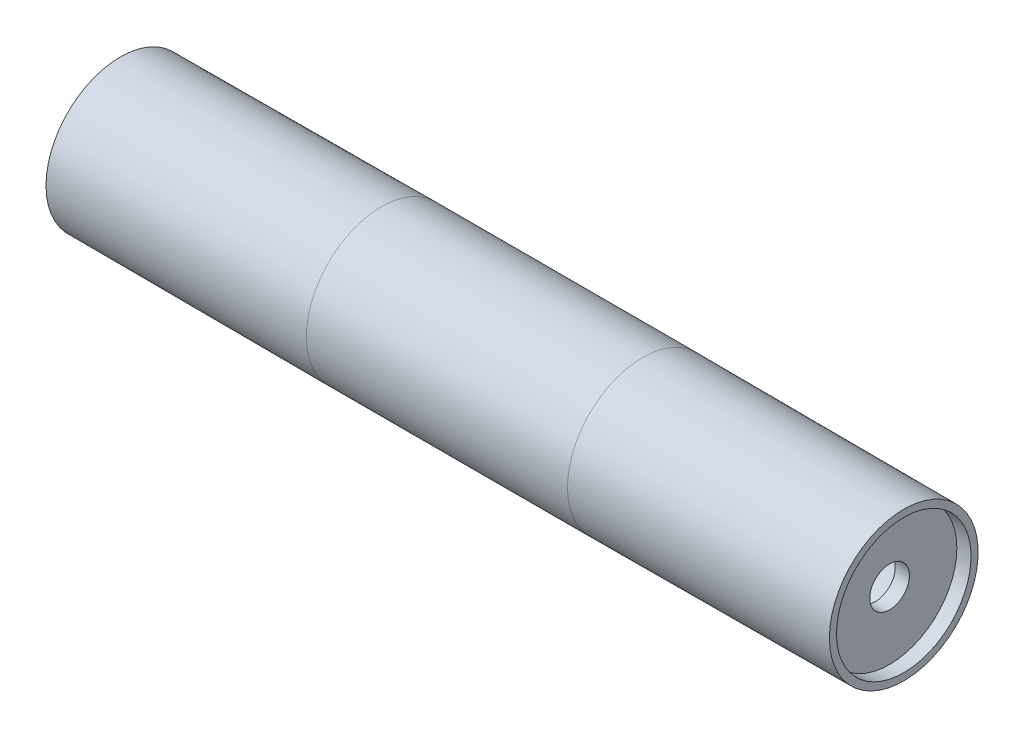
from build123d import *

# Parameters (mm, degrees)
ESQUISSE2_R             = 119
BOSS_EXTRU_1_DEPTH      = 25
ESQUISSE3_R             = 35
ENL_V_MAT_EXTRU_1_DEPTH = 1368.89528108


with BuildPart() as part:
    # Esquisse1 → Base-R_volution (revolve)
    with BuildSketch(Plane.XY, mode=Mode.PRIVATE) as base_r_volution_sk:
        Polygon((690, -118.5), (690, -131), (230, -132.5), (-230, -132.5), (-690, -131), (-690, -118.5), align=None)
    revolve(base_r_volution_sk.sketch.rotate(Axis((-457.495284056, 0, 0), (1, 0, 0)), 270), axis=Axis((-457.495284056, 0, 0), (1, 0, 0)))

    # Esquisse2 → Boss.-Extru.1 (add)
    with BuildSketch(Plane(origin=(665, 0, 0), x_dir=(0, 0, -1), z_dir=(1, 0, 0))):
        Circle(ESQUISSE2_R)
    boss_extru_1 = extrude(amount=-BOSS_EXTRU_1_DEPTH)

    # Sym_trie1: Boss.-Extru.1 across plane
    add(boss_extru_1.mirror(Plane(origin=(0, 0, 0), x_dir=(0, 0, 1), z_dir=(1, 0, 0))))

    # Esquisse3 → Enl_v. mat.-Extru.1 (cut, through all)
    with BuildSketch(Plane(origin=(665, 0, 0), x_dir=(0, 0, -1), z_dir=(1, 0, 0))):
        with Locations(Location((0, 0, 0), (0, 0, 180))):
            Circle(ESQUISSE3_R)
    extrude(amount=-ENL_V_MAT_EXTRU_1_DEPTH, mode=Mode.SUBTRACT)


solid = part.part
